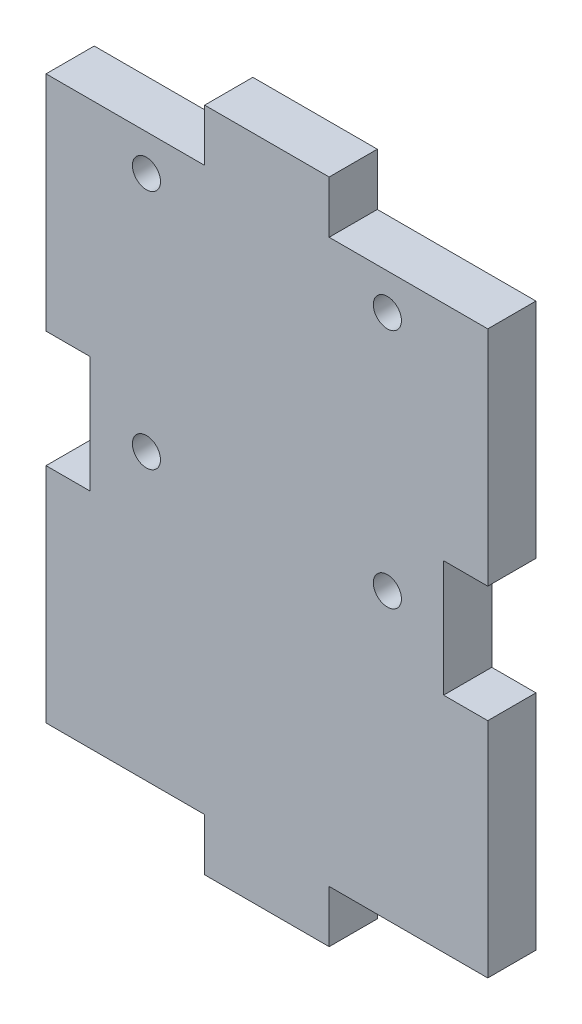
ISO-10303-21;
HEADER;
FILE_DESCRIPTION(('STEP AP214'),'2;1');
FILE_NAME('part.step','',(''),(''),'','','');
FILE_SCHEMA(('AUTOMOTIVE_DESIGN { 1 0 10303 214 1 1 1 1 }'));
ENDSEC;
DATA;
#1=APPLICATION_CONTEXT('core data for automotive mechanical design processes');
#2=APPLICATION_PROTOCOL_DEFINITION('international standard','automotive_design',2000,#1);
#3=PRODUCT_CONTEXT('',#1,'mechanical');
#4=PRODUCT('Part','Part','',(#3));
#5=PRODUCT_RELATED_PRODUCT_CATEGORY('part','',(#4));
#6=PRODUCT_DEFINITION_FORMATION('','',#4);
#7=PRODUCT_DEFINITION_CONTEXT('part definition',#1,'design');
#8=PRODUCT_DEFINITION('design','',#6,#7);
#9=PRODUCT_DEFINITION_SHAPE('','',#8);
#10=(LENGTH_UNIT() NAMED_UNIT(*) SI_UNIT(.MILLI.,.METRE.));
#11=(NAMED_UNIT(*) PLANE_ANGLE_UNIT() SI_UNIT($,.RADIAN.));
#12=(NAMED_UNIT(*) SI_UNIT($,.STERADIAN.) SOLID_ANGLE_UNIT());
#13=UNCERTAINTY_MEASURE_WITH_UNIT(LENGTH_MEASURE(1.E-05),#10,'distance_accuracy_value','');
#14=(GEOMETRIC_REPRESENTATION_CONTEXT(3) GLOBAL_UNCERTAINTY_ASSIGNED_CONTEXT((#13)) GLOBAL_UNIT_ASSIGNED_CONTEXT((#10,
#11,#12)) REPRESENTATION_CONTEXT('',''));
#15=CARTESIAN_POINT('',(0.,0.,0.));
#16=DIRECTION('',(0.,0.,1.));
#17=DIRECTION('',(1.,0.,0.));
#18=AXIS2_PLACEMENT_3D('',#15,#16,#17);
#19=CARTESIAN_POINT('',(7.75,34.9999999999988,6.));
#20=DIRECTION('',(0.,-1.,0.));
#21=DIRECTION('',(1.,0.,0.));
#22=AXIS2_PLACEMENT_3D('',#19,#20,#21);
#23=PLANE('',#22);
#24=DIRECTION('',(-1.,0.,0.));
#25=VECTOR('',#24,1.);
#26=CARTESIAN_POINT('',(7.75,34.9999999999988,0.));
#27=LINE('',#26,#25);
#28=CARTESIAN_POINT('',(27.5,35.,0.));
#29=VERTEX_POINT('',#28);
#30=CARTESIAN_POINT('',(7.75,34.9999999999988,0.));
#31=VERTEX_POINT('',#30);
#32=EDGE_CURVE('E204',#29,#31,#27,.T.);
#33=ORIENTED_EDGE('',*,*,#32,.T.);
#34=DIRECTION('',(0.,0.,-1.));
#35=VECTOR('',#34,1.);
#36=CARTESIAN_POINT('',(7.75,34.9999999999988,6.));
#37=LINE('',#36,#35);
#38=CARTESIAN_POINT('',(7.75,34.9999999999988,6.));
#39=VERTEX_POINT('',#38);
#40=EDGE_CURVE('E11',#39,#31,#37,.T.);
#41=ORIENTED_EDGE('',*,*,#40,.F.);
#42=DIRECTION('',(-1.,0.,0.));
#43=VECTOR('',#42,1.);
#44=CARTESIAN_POINT('',(7.75,34.9999999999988,6.));
#45=LINE('',#44,#43);
#46=CARTESIAN_POINT('',(27.5,35.,6.));
#47=VERTEX_POINT('',#46);
#48=EDGE_CURVE('E243',#47,#39,#45,.T.);
#49=ORIENTED_EDGE('',*,*,#48,.F.);
#50=DIRECTION('',(0.,0.,-1.));
#51=VECTOR('',#50,1.);
#52=CARTESIAN_POINT('',(27.5,35.,6.));
#53=LINE('',#52,#51);
#54=EDGE_CURVE('E200',#47,#29,#53,.T.);
#55=ORIENTED_EDGE('',*,*,#54,.T.);
#56=EDGE_LOOP('',(#33,#41,#49,#55));
#57=FACE_BOUND('',#56,.T.);
#58=ADVANCED_FACE('F36',(#57),#23,.F.);
#59=CARTESIAN_POINT('',(7.75,34.9999999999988,6.));
#60=DIRECTION('',(-1.,0.,0.));
#61=DIRECTION('',(0.,-1.,0.));
#62=AXIS2_PLACEMENT_3D('',#59,#60,#61);
#63=PLANE('',#62);
#64=DIRECTION('',(0.,1.,0.));
#65=VECTOR('',#64,1.);
#66=CARTESIAN_POINT('',(7.75,34.9999999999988,0.));
#67=LINE('',#66,#65);
#68=CARTESIAN_POINT('',(7.75,41.5,0.));
#69=VERTEX_POINT('',#68);
#70=EDGE_CURVE('E207',#31,#69,#67,.T.);
#71=ORIENTED_EDGE('',*,*,#70,.T.);
#72=DIRECTION('',(0.,0.,-1.));
#73=VECTOR('',#72,1.);
#74=CARTESIAN_POINT('',(7.75,41.5,6.));
#75=LINE('',#74,#73);
#76=CARTESIAN_POINT('',(7.75,41.5,6.));
#77=VERTEX_POINT('',#76);
#78=EDGE_CURVE('E44',#77,#69,#75,.T.);
#79=ORIENTED_EDGE('',*,*,#78,.F.);
#80=DIRECTION('',(0.,1.,0.));
#81=VECTOR('',#80,1.);
#82=CARTESIAN_POINT('',(7.75,34.9999999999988,6.));
#83=LINE('',#82,#81);
#84=EDGE_CURVE('E131',#39,#77,#83,.T.);
#85=ORIENTED_EDGE('',*,*,#84,.F.);
#86=ORIENTED_EDGE('',*,*,#40,.T.);
#87=EDGE_LOOP('',(#71,#79,#85,#86));
#88=FACE_BOUND('',#87,.T.);
#89=ADVANCED_FACE('F363',(#88),#63,.F.);
#90=CARTESIAN_POINT('',(-7.75,41.5,6.));
#91=DIRECTION('',(0.,-1.,0.));
#92=DIRECTION('',(0.,0.,-1.));
#93=AXIS2_PLACEMENT_3D('',#90,#91,#92);
#94=PLANE('',#93);
#95=DIRECTION('',(-1.,0.,0.));
#96=VECTOR('',#95,1.);
#97=CARTESIAN_POINT('',(-7.75,41.5,0.));
#98=LINE('',#97,#96);
#99=CARTESIAN_POINT('',(-7.75,41.5,0.));
#100=VERTEX_POINT('',#99);
#101=EDGE_CURVE('E210',#69,#100,#98,.T.);
#102=ORIENTED_EDGE('',*,*,#101,.T.);
#103=DIRECTION('',(0.,0.,-1.));
#104=VECTOR('',#103,1.);
#105=CARTESIAN_POINT('',(-7.75,41.5,6.));
#106=LINE('',#105,#104);
#107=CARTESIAN_POINT('',(-7.75,41.5,6.));
#108=VERTEX_POINT('',#107);
#109=EDGE_CURVE('E286',#108,#100,#106,.T.);
#110=ORIENTED_EDGE('',*,*,#109,.F.);
#111=DIRECTION('',(-1.,0.,0.));
#112=VECTOR('',#111,1.);
#113=CARTESIAN_POINT('',(-7.75,41.5,6.));
#114=LINE('',#113,#112);
#115=EDGE_CURVE('E294',#77,#108,#114,.T.);
#116=ORIENTED_EDGE('',*,*,#115,.F.);
#117=ORIENTED_EDGE('',*,*,#78,.T.);
#118=EDGE_LOOP('',(#102,#110,#116,#117));
#119=FACE_BOUND('',#118,.T.);
#120=ADVANCED_FACE('F292',(#119),#94,.F.);
#121=CARTESIAN_POINT('',(-7.75,35.,6.));
#122=DIRECTION('',(1.,0.,0.));
#123=DIRECTION('',(0.,0.,-1.));
#124=AXIS2_PLACEMENT_3D('',#121,#122,#123);
#125=PLANE('',#124);
#126=DIRECTION('',(0.,-1.,0.));
#127=VECTOR('',#126,1.);
#128=CARTESIAN_POINT('',(-7.75,35.,0.));
#129=LINE('',#128,#127);
#130=CARTESIAN_POINT('',(-7.75,35.,0.));
#131=VERTEX_POINT('',#130);
#132=EDGE_CURVE('E212',#100,#131,#129,.T.);
#133=ORIENTED_EDGE('',*,*,#132,.T.);
#134=DIRECTION('',(0.,0.,-1.));
#135=VECTOR('',#134,1.);
#136=CARTESIAN_POINT('',(-7.75,35.,6.));
#137=LINE('',#136,#135);
#138=CARTESIAN_POINT('',(-7.75,35.,6.));
#139=VERTEX_POINT('',#138);
#140=EDGE_CURVE('E283',#139,#131,#137,.T.);
#141=ORIENTED_EDGE('',*,*,#140,.F.);
#142=DIRECTION('',(0.,-1.,0.));
#143=VECTOR('',#142,1.);
#144=CARTESIAN_POINT('',(-7.75,35.,6.));
#145=LINE('',#144,#143);
#146=EDGE_CURVE('E312',#108,#139,#145,.T.);
#147=ORIENTED_EDGE('',*,*,#146,.F.);
#148=ORIENTED_EDGE('',*,*,#109,.T.);
#149=EDGE_LOOP('',(#133,#141,#147,#148));
#150=FACE_BOUND('',#149,.T.);
#151=ADVANCED_FACE('F303',(#150),#125,.F.);
#152=CARTESIAN_POINT('',(-27.5,35.,6.));
#153=DIRECTION('',(0.,-1.,0.));
#154=DIRECTION('',(0.,0.,-1.));
#155=AXIS2_PLACEMENT_3D('',#152,#153,#154);
#156=PLANE('',#155);
#157=DIRECTION('',(-1.,0.,0.));
#158=VECTOR('',#157,1.);
#159=CARTESIAN_POINT('',(-27.5,35.,0.));
#160=LINE('',#159,#158);
#161=CARTESIAN_POINT('',(-27.5,35.,0.));
#162=VERTEX_POINT('',#161);
#163=EDGE_CURVE('E214',#131,#162,#160,.T.);
#164=ORIENTED_EDGE('',*,*,#163,.T.);
#165=DIRECTION('',(0.,0.,-1.));
#166=VECTOR('',#165,1.);
#167=CARTESIAN_POINT('',(-27.5,35.,6.));
#168=LINE('',#167,#166);
#169=CARTESIAN_POINT('',(-27.5,35.,6.));
#170=VERTEX_POINT('',#169);
#171=EDGE_CURVE('E280',#170,#162,#168,.T.);
#172=ORIENTED_EDGE('',*,*,#171,.F.);
#173=DIRECTION('',(-1.,0.,0.));
#174=VECTOR('',#173,1.);
#175=CARTESIAN_POINT('',(-27.5,35.,6.));
#176=LINE('',#175,#174);
#177=EDGE_CURVE('E309',#139,#170,#176,.T.);
#178=ORIENTED_EDGE('',*,*,#177,.F.);
#179=ORIENTED_EDGE('',*,*,#140,.T.);
#180=EDGE_LOOP('',(#164,#172,#178,#179));
#181=FACE_BOUND('',#180,.T.);
#182=ADVANCED_FACE('F307',(#181),#156,.F.);
#183=CARTESIAN_POINT('',(-27.5,7.25000000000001,6.));
#184=DIRECTION('',(1.,0.,0.));
#185=DIRECTION('',(0.,0.,-1.));
#186=AXIS2_PLACEMENT_3D('',#183,#184,#185);
#187=PLANE('',#186);
#188=DIRECTION('',(0.,-1.,0.));
#189=VECTOR('',#188,1.);
#190=CARTESIAN_POINT('',(-27.5,7.25000000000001,0.));
#191=LINE('',#190,#189);
#192=CARTESIAN_POINT('',(-27.5,7.25000000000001,0.));
#193=VERTEX_POINT('',#192);
#194=EDGE_CURVE('E216',#162,#193,#191,.T.);
#195=ORIENTED_EDGE('',*,*,#194,.T.);
#196=DIRECTION('',(0.,0.,-1.));
#197=VECTOR('',#196,1.);
#198=CARTESIAN_POINT('',(-27.5,7.25000000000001,6.));
#199=LINE('',#198,#197);
#200=CARTESIAN_POINT('',(-27.5,7.25000000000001,6.));
#201=VERTEX_POINT('',#200);
#202=EDGE_CURVE('E277',#201,#193,#199,.T.);
#203=ORIENTED_EDGE('',*,*,#202,.F.);
#204=DIRECTION('',(0.,-1.,0.));
#205=VECTOR('',#204,1.);
#206=CARTESIAN_POINT('',(-27.5,7.25000000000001,6.));
#207=LINE('',#206,#205);
#208=EDGE_CURVE('E311',#170,#201,#207,.T.);
#209=ORIENTED_EDGE('',*,*,#208,.F.);
#210=ORIENTED_EDGE('',*,*,#171,.T.);
#211=EDGE_LOOP('',(#195,#203,#209,#210));
#212=FACE_BOUND('',#211,.T.);
#213=ADVANCED_FACE('F376',(#212),#187,.F.);
#214=CARTESIAN_POINT('',(-27.5,7.25000000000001,6.));
#215=DIRECTION('',(0.,1.,0.));
#216=DIRECTION('',(0.,0.,1.));
#217=AXIS2_PLACEMENT_3D('',#214,#215,#216);
#218=PLANE('',#217);
#219=DIRECTION('',(1.,0.,0.));
#220=VECTOR('',#219,1.);
#221=CARTESIAN_POINT('',(-27.5,7.25000000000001,0.));
#222=LINE('',#221,#220);
#223=CARTESIAN_POINT('',(-22.,7.25000000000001,0.));
#224=VERTEX_POINT('',#223);
#225=EDGE_CURVE('E218',#193,#224,#222,.T.);
#226=ORIENTED_EDGE('',*,*,#225,.T.);
#227=DIRECTION('',(0.,0.,-1.));
#228=VECTOR('',#227,1.);
#229=CARTESIAN_POINT('',(-22.,7.25000000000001,6.));
#230=LINE('',#229,#228);
#231=CARTESIAN_POINT('',(-22.,7.25000000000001,6.));
#232=VERTEX_POINT('',#231);
#233=EDGE_CURVE('E274',#232,#224,#230,.T.);
#234=ORIENTED_EDGE('',*,*,#233,.F.);
#235=DIRECTION('',(1.,0.,0.));
#236=VECTOR('',#235,1.);
#237=CARTESIAN_POINT('',(-27.5,7.25000000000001,6.));
#238=LINE('',#237,#236);
#239=EDGE_CURVE('E314',#201,#232,#238,.T.);
#240=ORIENTED_EDGE('',*,*,#239,.F.);
#241=ORIENTED_EDGE('',*,*,#202,.T.);
#242=EDGE_LOOP('',(#226,#234,#240,#241));
#243=FACE_BOUND('',#242,.T.);
#244=ADVANCED_FACE('F379',(#243),#218,.F.);
#245=CARTESIAN_POINT('',(-22.,-7.24999999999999,6.));
#246=DIRECTION('',(1.,0.,0.));
#247=DIRECTION('',(0.,0.,-1.));
#248=AXIS2_PLACEMENT_3D('',#245,#246,#247);
#249=PLANE('',#248);
#250=DIRECTION('',(0.,-1.,0.));
#251=VECTOR('',#250,1.);
#252=CARTESIAN_POINT('',(-22.,-7.24999999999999,0.));
#253=LINE('',#252,#251);
#254=CARTESIAN_POINT('',(-22.,-7.24999999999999,0.));
#255=VERTEX_POINT('',#254);
#256=EDGE_CURVE('E220',#224,#255,#253,.T.);
#257=ORIENTED_EDGE('',*,*,#256,.T.);
#258=DIRECTION('',(0.,0.,-1.));
#259=VECTOR('',#258,1.);
#260=CARTESIAN_POINT('',(-22.,-7.24999999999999,6.));
#261=LINE('',#260,#259);
#262=CARTESIAN_POINT('',(-22.,-7.24999999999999,6.));
#263=VERTEX_POINT('',#262);
#264=EDGE_CURVE('E271',#263,#255,#261,.T.);
#265=ORIENTED_EDGE('',*,*,#264,.F.);
#266=DIRECTION('',(0.,-1.,0.));
#267=VECTOR('',#266,1.);
#268=CARTESIAN_POINT('',(-22.,-7.24999999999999,6.));
#269=LINE('',#268,#267);
#270=EDGE_CURVE('E320',#232,#263,#269,.T.);
#271=ORIENTED_EDGE('',*,*,#270,.F.);
#272=ORIENTED_EDGE('',*,*,#233,.T.);
#273=EDGE_LOOP('',(#257,#265,#271,#272));
#274=FACE_BOUND('',#273,.T.);
#275=ADVANCED_FACE('F383',(#274),#249,.F.);
#276=CARTESIAN_POINT('',(-27.5,-7.24999999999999,6.));
#277=DIRECTION('',(0.,-1.,0.));
#278=DIRECTION('',(1.,0.,0.));
#279=AXIS2_PLACEMENT_3D('',#276,#277,#278);
#280=PLANE('',#279);
#281=DIRECTION('',(-1.,0.,0.));
#282=VECTOR('',#281,1.);
#283=CARTESIAN_POINT('',(-27.5,-7.24999999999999,0.));
#284=LINE('',#283,#282);
#285=CARTESIAN_POINT('',(-27.5,-7.24999999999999,0.));
#286=VERTEX_POINT('',#285);
#287=EDGE_CURVE('E222',#255,#286,#284,.T.);
#288=ORIENTED_EDGE('',*,*,#287,.T.);
#289=DIRECTION('',(0.,0.,-1.));
#290=VECTOR('',#289,1.);
#291=CARTESIAN_POINT('',(-27.5,-7.24999999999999,6.));
#292=LINE('',#291,#290);
#293=CARTESIAN_POINT('',(-27.5,-7.24999999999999,6.));
#294=VERTEX_POINT('',#293);
#295=EDGE_CURVE('E268',#294,#286,#292,.T.);
#296=ORIENTED_EDGE('',*,*,#295,.F.);
#297=DIRECTION('',(-1.,0.,0.));
#298=VECTOR('',#297,1.);
#299=CARTESIAN_POINT('',(-27.5,-7.24999999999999,6.));
#300=LINE('',#299,#298);
#301=EDGE_CURVE('E322',#263,#294,#300,.T.);
#302=ORIENTED_EDGE('',*,*,#301,.F.);
#303=ORIENTED_EDGE('',*,*,#264,.T.);
#304=EDGE_LOOP('',(#288,#296,#302,#303));
#305=FACE_BOUND('',#304,.T.);
#306=ADVANCED_FACE('F387',(#305),#280,.F.);
#307=CARTESIAN_POINT('',(-27.5,-35.,6.));
#308=DIRECTION('',(1.,0.,0.));
#309=DIRECTION('',(0.,0.,-1.));
#310=AXIS2_PLACEMENT_3D('',#307,#308,#309);
#311=PLANE('',#310);
#312=DIRECTION('',(0.,-1.,0.));
#313=VECTOR('',#312,1.);
#314=CARTESIAN_POINT('',(-27.5,-35.,0.));
#315=LINE('',#314,#313);
#316=CARTESIAN_POINT('',(-27.5,-35.,0.));
#317=VERTEX_POINT('',#316);
#318=EDGE_CURVE('E224',#286,#317,#315,.T.);
#319=ORIENTED_EDGE('',*,*,#318,.T.);
#320=DIRECTION('',(0.,0.,-1.));
#321=VECTOR('',#320,1.);
#322=CARTESIAN_POINT('',(-27.5,-35.,6.));
#323=LINE('',#322,#321);
#324=CARTESIAN_POINT('',(-27.5,-35.,6.));
#325=VERTEX_POINT('',#324);
#326=EDGE_CURVE('E265',#325,#317,#323,.T.);
#327=ORIENTED_EDGE('',*,*,#326,.F.);
#328=DIRECTION('',(0.,-1.,0.));
#329=VECTOR('',#328,1.);
#330=CARTESIAN_POINT('',(-27.5,-35.,6.));
#331=LINE('',#330,#329);
#332=EDGE_CURVE('E324',#294,#325,#331,.T.);
#333=ORIENTED_EDGE('',*,*,#332,.F.);
#334=ORIENTED_EDGE('',*,*,#295,.T.);
#335=EDGE_LOOP('',(#319,#327,#333,#334));
#336=FACE_BOUND('',#335,.T.);
#337=ADVANCED_FACE('F391',(#336),#311,.F.);
#338=CARTESIAN_POINT('',(-27.5,-35.,6.));
#339=DIRECTION('',(0.,1.,0.));
#340=DIRECTION('',(0.,0.,1.));
#341=AXIS2_PLACEMENT_3D('',#338,#339,#340);
#342=PLANE('',#341);
#343=DIRECTION('',(1.,0.,0.));
#344=VECTOR('',#343,1.);
#345=CARTESIAN_POINT('',(-27.5,-35.,0.));
#346=LINE('',#345,#344);
#347=CARTESIAN_POINT('',(-7.75,-35.,0.));
#348=VERTEX_POINT('',#347);
#349=EDGE_CURVE('E226',#317,#348,#346,.T.);
#350=ORIENTED_EDGE('',*,*,#349,.T.);
#351=DIRECTION('',(0.,0.,-1.));
#352=VECTOR('',#351,1.);
#353=CARTESIAN_POINT('',(-7.75,-35.,6.));
#354=LINE('',#353,#352);
#355=CARTESIAN_POINT('',(-7.75,-35.,6.));
#356=VERTEX_POINT('',#355);
#357=EDGE_CURVE('E262',#356,#348,#354,.T.);
#358=ORIENTED_EDGE('',*,*,#357,.F.);
#359=DIRECTION('',(1.,0.,0.));
#360=VECTOR('',#359,1.);
#361=CARTESIAN_POINT('',(-27.5,-35.,6.));
#362=LINE('',#361,#360);
#363=EDGE_CURVE('E326',#325,#356,#362,.T.);
#364=ORIENTED_EDGE('',*,*,#363,.F.);
#365=ORIENTED_EDGE('',*,*,#326,.T.);
#366=EDGE_LOOP('',(#350,#358,#364,#365));
#367=FACE_BOUND('',#366,.T.);
#368=ADVANCED_FACE('F395',(#367),#342,.F.);
#369=CARTESIAN_POINT('',(-7.75,-35.,6.));
#370=DIRECTION('',(1.,0.,0.));
#371=DIRECTION('',(0.,1.,0.));
#372=AXIS2_PLACEMENT_3D('',#369,#370,#371);
#373=PLANE('',#372);
#374=DIRECTION('',(0.,-1.,0.));
#375=VECTOR('',#374,1.);
#376=CARTESIAN_POINT('',(-7.75,-35.,0.));
#377=LINE('',#376,#375);
#378=CARTESIAN_POINT('',(-7.75,-41.5,0.));
#379=VERTEX_POINT('',#378);
#380=EDGE_CURVE('E228',#348,#379,#377,.T.);
#381=ORIENTED_EDGE('',*,*,#380,.T.);
#382=DIRECTION('',(0.,0.,-1.));
#383=VECTOR('',#382,1.);
#384=CARTESIAN_POINT('',(-7.75,-41.5,6.));
#385=LINE('',#384,#383);
#386=CARTESIAN_POINT('',(-7.75,-41.5,6.));
#387=VERTEX_POINT('',#386);
#388=EDGE_CURVE('E259',#387,#379,#385,.T.);
#389=ORIENTED_EDGE('',*,*,#388,.F.);
#390=DIRECTION('',(0.,-1.,0.));
#391=VECTOR('',#390,1.);
#392=CARTESIAN_POINT('',(-7.75,-35.,6.));
#393=LINE('',#392,#391);
#394=EDGE_CURVE('E328',#356,#387,#393,.T.);
#395=ORIENTED_EDGE('',*,*,#394,.F.);
#396=ORIENTED_EDGE('',*,*,#357,.T.);
#397=EDGE_LOOP('',(#381,#389,#395,#396));
#398=FACE_BOUND('',#397,.T.);
#399=ADVANCED_FACE('F399',(#398),#373,.F.);
#400=CARTESIAN_POINT('',(-7.75,-41.5,6.));
#401=DIRECTION('',(0.,1.,0.));
#402=DIRECTION('',(0.,0.,1.));
#403=AXIS2_PLACEMENT_3D('',#400,#401,#402);
#404=PLANE('',#403);
#405=DIRECTION('',(1.,0.,0.));
#406=VECTOR('',#405,1.);
#407=CARTESIAN_POINT('',(-7.75,-41.5,0.));
#408=LINE('',#407,#406);
#409=CARTESIAN_POINT('',(7.75,-41.5,0.));
#410=VERTEX_POINT('',#409);
#411=EDGE_CURVE('E230',#379,#410,#408,.T.);
#412=ORIENTED_EDGE('',*,*,#411,.T.);
#413=DIRECTION('',(0.,0.,-1.));
#414=VECTOR('',#413,1.);
#415=CARTESIAN_POINT('',(7.75,-41.5,6.));
#416=LINE('',#415,#414);
#417=CARTESIAN_POINT('',(7.75,-41.5,6.));
#418=VERTEX_POINT('',#417);
#419=EDGE_CURVE('E256',#418,#410,#416,.T.);
#420=ORIENTED_EDGE('',*,*,#419,.F.);
#421=DIRECTION('',(1.,0.,0.));
#422=VECTOR('',#421,1.);
#423=CARTESIAN_POINT('',(-7.75,-41.5,6.));
#424=LINE('',#423,#422);
#425=EDGE_CURVE('E330',#387,#418,#424,.T.);
#426=ORIENTED_EDGE('',*,*,#425,.F.);
#427=ORIENTED_EDGE('',*,*,#388,.T.);
#428=EDGE_LOOP('',(#412,#420,#426,#427));
#429=FACE_BOUND('',#428,.T.);
#430=ADVANCED_FACE('F403',(#429),#404,.F.);
#431=CARTESIAN_POINT('',(7.75,-35.,6.));
#432=DIRECTION('',(-1.,0.,0.));
#433=DIRECTION('',(0.,-1.,0.));
#434=AXIS2_PLACEMENT_3D('',#431,#432,#433);
#435=PLANE('',#434);
#436=DIRECTION('',(0.,1.,0.));
#437=VECTOR('',#436,1.);
#438=CARTESIAN_POINT('',(7.75,-35.,0.));
#439=LINE('',#438,#437);
#440=CARTESIAN_POINT('',(7.75,-35.,0.));
#441=VERTEX_POINT('',#440);
#442=EDGE_CURVE('E232',#410,#441,#439,.T.);
#443=ORIENTED_EDGE('',*,*,#442,.T.);
#444=DIRECTION('',(0.,0.,-1.));
#445=VECTOR('',#444,1.);
#446=CARTESIAN_POINT('',(7.75,-35.,6.));
#447=LINE('',#446,#445);
#448=CARTESIAN_POINT('',(7.75,-35.,6.));
#449=VERTEX_POINT('',#448);
#450=EDGE_CURVE('E253',#449,#441,#447,.T.);
#451=ORIENTED_EDGE('',*,*,#450,.F.);
#452=DIRECTION('',(0.,1.,0.));
#453=VECTOR('',#452,1.);
#454=CARTESIAN_POINT('',(7.75,-35.,6.));
#455=LINE('',#454,#453);
#456=EDGE_CURVE('E332',#418,#449,#455,.T.);
#457=ORIENTED_EDGE('',*,*,#456,.F.);
#458=ORIENTED_EDGE('',*,*,#419,.T.);
#459=EDGE_LOOP('',(#443,#451,#457,#458));
#460=FACE_BOUND('',#459,.T.);
#461=ADVANCED_FACE('F407',(#460),#435,.F.);
#462=CARTESIAN_POINT('',(7.75,-35.,6.));
#463=DIRECTION('',(0.,1.,0.));
#464=DIRECTION('',(0.,0.,1.));
#465=AXIS2_PLACEMENT_3D('',#462,#463,#464);
#466=PLANE('',#465);
#467=DIRECTION('',(1.,0.,0.));
#468=VECTOR('',#467,1.);
#469=CARTESIAN_POINT('',(7.75,-35.,0.));
#470=LINE('',#469,#468);
#471=CARTESIAN_POINT('',(27.5,-35.,0.));
#472=VERTEX_POINT('',#471);
#473=EDGE_CURVE('E234',#441,#472,#470,.T.);
#474=ORIENTED_EDGE('',*,*,#473,.T.);
#475=DIRECTION('',(0.,0.,-1.));
#476=VECTOR('',#475,1.);
#477=CARTESIAN_POINT('',(27.5,-35.,6.));
#478=LINE('',#477,#476);
#479=CARTESIAN_POINT('',(27.5,-35.,6.));
#480=VERTEX_POINT('',#479);
#481=EDGE_CURVE('E250',#480,#472,#478,.T.);
#482=ORIENTED_EDGE('',*,*,#481,.F.);
#483=DIRECTION('',(1.,0.,0.));
#484=VECTOR('',#483,1.);
#485=CARTESIAN_POINT('',(7.75,-35.,6.));
#486=LINE('',#485,#484);
#487=EDGE_CURVE('E334',#449,#480,#486,.T.);
#488=ORIENTED_EDGE('',*,*,#487,.F.);
#489=ORIENTED_EDGE('',*,*,#450,.T.);
#490=EDGE_LOOP('',(#474,#482,#488,#489));
#491=FACE_BOUND('',#490,.T.);
#492=ADVANCED_FACE('F411',(#491),#466,.F.);
#493=CARTESIAN_POINT('',(27.5,-35.,6.));
#494=DIRECTION('',(-1.,0.,0.));
#495=DIRECTION('',(0.,-1.,0.));
#496=AXIS2_PLACEMENT_3D('',#493,#494,#495);
#497=PLANE('',#496);
#498=DIRECTION('',(0.,1.,0.));
#499=VECTOR('',#498,1.);
#500=CARTESIAN_POINT('',(27.5,-35.,0.));
#501=LINE('',#500,#499);
#502=CARTESIAN_POINT('',(27.5000000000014,-7.24999999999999,0.));
#503=VERTEX_POINT('',#502);
#504=EDGE_CURVE('E236',#472,#503,#501,.T.);
#505=ORIENTED_EDGE('',*,*,#504,.T.);
#506=DIRECTION('',(0.,0.,-1.));
#507=VECTOR('',#506,1.);
#508=CARTESIAN_POINT('',(27.5000000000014,-7.24999999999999,6.));
#509=LINE('',#508,#507);
#510=CARTESIAN_POINT('',(27.5000000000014,-7.24999999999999,6.));
#511=VERTEX_POINT('',#510);
#512=EDGE_CURVE('E247',#511,#503,#509,.T.);
#513=ORIENTED_EDGE('',*,*,#512,.F.);
#514=DIRECTION('',(0.,1.,0.));
#515=VECTOR('',#514,1.);
#516=CARTESIAN_POINT('',(27.5,-35.,6.));
#517=LINE('',#516,#515);
#518=EDGE_CURVE('E336',#480,#511,#517,.T.);
#519=ORIENTED_EDGE('',*,*,#518,.F.);
#520=ORIENTED_EDGE('',*,*,#481,.T.);
#521=EDGE_LOOP('',(#505,#513,#519,#520));
#522=FACE_BOUND('',#521,.T.);
#523=ADVANCED_FACE('F342',(#522),#497,.F.);
#524=CARTESIAN_POINT('',(27.5000000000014,-7.24999999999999,6.));
#525=DIRECTION('',(0.,-1.,0.));
#526=DIRECTION('',(1.,0.,0.));
#527=AXIS2_PLACEMENT_3D('',#524,#525,#526);
#528=PLANE('',#527);
#529=DIRECTION('',(-1.,0.,0.));
#530=VECTOR('',#529,1.);
#531=CARTESIAN_POINT('',(27.5000000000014,-7.24999999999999,0.));
#532=LINE('',#531,#530);
#533=CARTESIAN_POINT('',(22.,-7.24999999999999,0.));
#534=VERTEX_POINT('',#533);
#535=EDGE_CURVE('E238',#503,#534,#532,.T.);
#536=ORIENTED_EDGE('',*,*,#535,.T.);
#537=DIRECTION('',(0.,0.,-1.));
#538=VECTOR('',#537,1.);
#539=CARTESIAN_POINT('',(22.,-7.24999999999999,6.));
#540=LINE('',#539,#538);
#541=CARTESIAN_POINT('',(22.,-7.24999999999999,6.));
#542=VERTEX_POINT('',#541);
#543=EDGE_CURVE('E195',#542,#534,#540,.T.);
#544=ORIENTED_EDGE('',*,*,#543,.F.);
#545=DIRECTION('',(-1.,0.,0.));
#546=VECTOR('',#545,1.);
#547=CARTESIAN_POINT('',(27.5000000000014,-7.24999999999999,6.));
#548=LINE('',#547,#546);
#549=EDGE_CURVE('E186',#511,#542,#548,.T.);
#550=ORIENTED_EDGE('',*,*,#549,.F.);
#551=ORIENTED_EDGE('',*,*,#512,.T.);
#552=EDGE_LOOP('',(#536,#544,#550,#551));
#553=FACE_BOUND('',#552,.T.);
#554=ADVANCED_FACE('F346',(#553),#528,.F.);
#555=CARTESIAN_POINT('',(22.,-7.24999999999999,6.));
#556=DIRECTION('',(-1.,0.,0.));
#557=DIRECTION('',(0.,0.,1.));
#558=AXIS2_PLACEMENT_3D('',#555,#556,#557);
#559=PLANE('',#558);
#560=DIRECTION('',(0.,1.,0.));
#561=VECTOR('',#560,1.);
#562=CARTESIAN_POINT('',(22.,-7.24999999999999,0.));
#563=LINE('',#562,#561);
#564=CARTESIAN_POINT('',(22.,7.25000000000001,0.));
#565=VERTEX_POINT('',#564);
#566=EDGE_CURVE('E194',#534,#565,#563,.T.);
#567=ORIENTED_EDGE('',*,*,#566,.T.);
#568=DIRECTION('',(0.,0.,-1.));
#569=VECTOR('',#568,1.);
#570=CARTESIAN_POINT('',(22.,7.25000000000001,6.));
#571=LINE('',#570,#569);
#572=CARTESIAN_POINT('',(22.,7.25000000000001,6.));
#573=VERTEX_POINT('',#572);
#574=EDGE_CURVE('E191',#573,#565,#571,.T.);
#575=ORIENTED_EDGE('',*,*,#574,.F.);
#576=DIRECTION('',(0.,1.,0.));
#577=VECTOR('',#576,1.);
#578=CARTESIAN_POINT('',(22.,-7.24999999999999,6.));
#579=LINE('',#578,#577);
#580=EDGE_CURVE('E180',#542,#573,#579,.T.);
#581=ORIENTED_EDGE('',*,*,#580,.F.);
#582=ORIENTED_EDGE('',*,*,#543,.T.);
#583=EDGE_LOOP('',(#567,#575,#581,#582));
#584=FACE_BOUND('',#583,.T.);
#585=ADVANCED_FACE('F192',(#584),#559,.F.);
#586=CARTESIAN_POINT('',(27.5,7.25000000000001,6.));
#587=DIRECTION('',(0.,1.,0.));
#588=DIRECTION('',(0.,0.,1.));
#589=AXIS2_PLACEMENT_3D('',#586,#587,#588);
#590=PLANE('',#589);
#591=DIRECTION('',(1.,0.,0.));
#592=VECTOR('',#591,1.);
#593=CARTESIAN_POINT('',(27.5,7.25000000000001,0.));
#594=LINE('',#593,#592);
#595=CARTESIAN_POINT('',(27.5,7.25000000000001,0.));
#596=VERTEX_POINT('',#595);
#597=EDGE_CURVE('E117',#565,#596,#594,.T.);
#598=ORIENTED_EDGE('',*,*,#597,.T.);
#599=DIRECTION('',(0.,0.,-1.));
#600=VECTOR('',#599,1.);
#601=CARTESIAN_POINT('',(27.5,7.25000000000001,6.));
#602=LINE('',#601,#600);
#603=CARTESIAN_POINT('',(27.5,7.25000000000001,6.));
#604=VERTEX_POINT('',#603);
#605=EDGE_CURVE('E196',#604,#596,#602,.T.);
#606=ORIENTED_EDGE('',*,*,#605,.F.);
#607=DIRECTION('',(1.,0.,0.));
#608=VECTOR('',#607,1.);
#609=CARTESIAN_POINT('',(27.5,7.25000000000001,6.));
#610=LINE('',#609,#608);
#611=EDGE_CURVE('E184',#573,#604,#610,.T.);
#612=ORIENTED_EDGE('',*,*,#611,.F.);
#613=ORIENTED_EDGE('',*,*,#574,.T.);
#614=EDGE_LOOP('',(#598,#606,#612,#613));
#615=FACE_BOUND('',#614,.T.);
#616=ADVANCED_FACE('F198',(#615),#590,.F.);
#617=CARTESIAN_POINT('',(27.5,7.25000000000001,6.));
#618=DIRECTION('',(-1.,0.,0.));
#619=DIRECTION('',(0.,0.,1.));
#620=AXIS2_PLACEMENT_3D('',#617,#618,#619);
#621=PLANE('',#620);
#622=DIRECTION('',(0.,1.,0.));
#623=VECTOR('',#622,1.);
#624=CARTESIAN_POINT('',(27.5,7.25000000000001,0.));
#625=LINE('',#624,#623);
#626=EDGE_CURVE('E123',#596,#29,#625,.T.);
#627=ORIENTED_EDGE('',*,*,#626,.T.);
#628=ORIENTED_EDGE('',*,*,#54,.F.);
#629=DIRECTION('',(0.,1.,0.));
#630=VECTOR('',#629,1.);
#631=CARTESIAN_POINT('',(27.5,7.25000000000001,6.));
#632=LINE('',#631,#630);
#633=EDGE_CURVE('E52',#604,#47,#632,.T.);
#634=ORIENTED_EDGE('',*,*,#633,.F.);
#635=ORIENTED_EDGE('',*,*,#605,.T.);
#636=EDGE_LOOP('',(#627,#628,#634,#635));
#637=FACE_BOUND('',#636,.T.);
#638=ADVANCED_FACE('F350',(#637),#621,.F.);
#639=CARTESIAN_POINT('',(0.,0.,6.));
#640=DIRECTION('',(0.,0.,1.));
#641=DIRECTION('',(1.,0.,0.));
#642=AXIS2_PLACEMENT_3D('',#639,#640,#641);
#643=PLANE('',#642);
#644=CARTESIAN_POINT('',(-15.,0.500000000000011,6.));
#645=DIRECTION('',(0.,0.,1.));
#646=DIRECTION('',(1.,0.,0.));
#647=AXIS2_PLACEMENT_3D('',#644,#645,#646);
#648=CIRCLE('',#647,1.75);
#649=CARTESIAN_POINT('',(-13.25,0.500000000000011,6.));
#650=VERTEX_POINT('',#649);
#651=EDGE_CURVE('E208',#650,#650,#648,.T.);
#652=ORIENTED_EDGE('',*,*,#651,.F.);
#653=EDGE_LOOP('',(#652));
#654=FACE_BOUND('',#653,.T.);
#655=CARTESIAN_POINT('',(15.,0.500000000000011,6.));
#656=DIRECTION('',(0.,0.,1.));
#657=DIRECTION('',(1.,0.,0.));
#658=AXIS2_PLACEMENT_3D('',#655,#656,#657);
#659=CIRCLE('',#658,1.75);
#660=CARTESIAN_POINT('',(16.75,0.500000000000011,6.));
#661=VERTEX_POINT('',#660);
#662=EDGE_CURVE('E662',#661,#661,#659,.T.);
#663=ORIENTED_EDGE('',*,*,#662,.F.);
#664=EDGE_LOOP('',(#663));
#665=FACE_BOUND('',#664,.T.);
#666=CARTESIAN_POINT('',(15.,30.5,6.));
#667=DIRECTION('',(0.,0.,1.));
#668=DIRECTION('',(1.,0.,0.));
#669=AXIS2_PLACEMENT_3D('',#666,#667,#668);
#670=CIRCLE('',#669,1.75);
#671=CARTESIAN_POINT('',(16.75,30.5,6.));
#672=VERTEX_POINT('',#671);
#673=EDGE_CURVE('E659',#672,#672,#670,.T.);
#674=ORIENTED_EDGE('',*,*,#673,.F.);
#675=EDGE_LOOP('',(#674));
#676=FACE_BOUND('',#675,.T.);
#677=CARTESIAN_POINT('',(-15.,30.5,6.));
#678=DIRECTION('',(0.,0.,1.));
#679=DIRECTION('',(1.,0.,0.));
#680=AXIS2_PLACEMENT_3D('',#677,#678,#679);
#681=CIRCLE('',#680,1.75);
#682=CARTESIAN_POINT('',(-13.25,30.5,6.));
#683=VERTEX_POINT('',#682);
#684=EDGE_CURVE('E656',#683,#683,#681,.T.);
#685=ORIENTED_EDGE('',*,*,#684,.F.);
#686=EDGE_LOOP('',(#685));
#687=FACE_BOUND('',#686,.T.);
#688=ORIENTED_EDGE('',*,*,#48,.T.);
#689=ORIENTED_EDGE('',*,*,#84,.T.);
#690=ORIENTED_EDGE('',*,*,#115,.T.);
#691=ORIENTED_EDGE('',*,*,#146,.T.);
#692=ORIENTED_EDGE('',*,*,#177,.T.);
#693=ORIENTED_EDGE('',*,*,#208,.T.);
#694=ORIENTED_EDGE('',*,*,#239,.T.);
#695=ORIENTED_EDGE('',*,*,#270,.T.);
#696=ORIENTED_EDGE('',*,*,#301,.T.);
#697=ORIENTED_EDGE('',*,*,#332,.T.);
#698=ORIENTED_EDGE('',*,*,#363,.T.);
#699=ORIENTED_EDGE('',*,*,#394,.T.);
#700=ORIENTED_EDGE('',*,*,#425,.T.);
#701=ORIENTED_EDGE('',*,*,#456,.T.);
#702=ORIENTED_EDGE('',*,*,#487,.T.);
#703=ORIENTED_EDGE('',*,*,#518,.T.);
#704=ORIENTED_EDGE('',*,*,#549,.T.);
#705=ORIENTED_EDGE('',*,*,#580,.T.);
#706=ORIENTED_EDGE('',*,*,#611,.T.);
#707=ORIENTED_EDGE('',*,*,#633,.T.);
#708=EDGE_LOOP('',(#688,#689,#690,#691,#692,#693,#694,#695,#696,#697,#698,#699,#700,#701,#702,
#703,#704,#705,#706,#707));
#709=FACE_BOUND('',#708,.T.);
#710=ADVANCED_FACE('F182',(#654,#665,#676,#687,#709),#643,.T.);
#711=CARTESIAN_POINT('',(0.,0.,0.));
#712=DIRECTION('',(0.,0.,1.));
#713=DIRECTION('',(1.,0.,0.));
#714=AXIS2_PLACEMENT_3D('',#711,#712,#713);
#715=PLANE('',#714);
#716=CARTESIAN_POINT('',(-15.,0.500000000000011,0.));
#717=DIRECTION('',(0.,0.,1.));
#718=DIRECTION('',(-1.,0.,0.));
#719=AXIS2_PLACEMENT_3D('',#716,#717,#718);
#720=CIRCLE('',#719,1.75);
#721=CARTESIAN_POINT('',(-16.75,0.500000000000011,0.));
#722=VERTEX_POINT('',#721);
#723=EDGE_CURVE('E645',#722,#722,#720,.T.);
#724=ORIENTED_EDGE('',*,*,#723,.T.);
#725=EDGE_LOOP('',(#724));
#726=FACE_BOUND('',#725,.T.);
#727=CARTESIAN_POINT('',(15.,0.500000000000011,0.));
#728=DIRECTION('',(0.,0.,1.));
#729=DIRECTION('',(1.,0.,0.));
#730=AXIS2_PLACEMENT_3D('',#727,#728,#729);
#731=CIRCLE('',#730,1.75);
#732=CARTESIAN_POINT('',(16.75,0.500000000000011,0.));
#733=VERTEX_POINT('',#732);
#734=EDGE_CURVE('E646',#733,#733,#731,.T.);
#735=ORIENTED_EDGE('',*,*,#734,.T.);
#736=EDGE_LOOP('',(#735));
#737=FACE_BOUND('',#736,.T.);
#738=CARTESIAN_POINT('',(15.,30.5,0.));
#739=DIRECTION('',(0.,0.,1.));
#740=DIRECTION('',(-1.,0.,0.));
#741=AXIS2_PLACEMENT_3D('',#738,#739,#740);
#742=CIRCLE('',#741,1.75);
#743=CARTESIAN_POINT('',(13.25,30.5,0.));
#744=VERTEX_POINT('',#743);
#745=EDGE_CURVE('E649',#744,#744,#742,.T.);
#746=ORIENTED_EDGE('',*,*,#745,.T.);
#747=EDGE_LOOP('',(#746));
#748=FACE_BOUND('',#747,.T.);
#749=CARTESIAN_POINT('',(-15.,30.5,0.));
#750=DIRECTION('',(0.,0.,1.));
#751=DIRECTION('',(1.,0.,0.));
#752=AXIS2_PLACEMENT_3D('',#749,#750,#751);
#753=CIRCLE('',#752,1.75);
#754=CARTESIAN_POINT('',(-13.25,30.5,0.));
#755=VERTEX_POINT('',#754);
#756=EDGE_CURVE('E653',#755,#755,#753,.T.);
#757=ORIENTED_EDGE('',*,*,#756,.T.);
#758=EDGE_LOOP('',(#757));
#759=FACE_BOUND('',#758,.T.);
#760=ORIENTED_EDGE('',*,*,#32,.F.);
#761=ORIENTED_EDGE('',*,*,#626,.F.);
#762=ORIENTED_EDGE('',*,*,#597,.F.);
#763=ORIENTED_EDGE('',*,*,#566,.F.);
#764=ORIENTED_EDGE('',*,*,#535,.F.);
#765=ORIENTED_EDGE('',*,*,#504,.F.);
#766=ORIENTED_EDGE('',*,*,#473,.F.);
#767=ORIENTED_EDGE('',*,*,#442,.F.);
#768=ORIENTED_EDGE('',*,*,#411,.F.);
#769=ORIENTED_EDGE('',*,*,#380,.F.);
#770=ORIENTED_EDGE('',*,*,#349,.F.);
#771=ORIENTED_EDGE('',*,*,#318,.F.);
#772=ORIENTED_EDGE('',*,*,#287,.F.);
#773=ORIENTED_EDGE('',*,*,#256,.F.);
#774=ORIENTED_EDGE('',*,*,#225,.F.);
#775=ORIENTED_EDGE('',*,*,#194,.F.);
#776=ORIENTED_EDGE('',*,*,#163,.F.);
#777=ORIENTED_EDGE('',*,*,#132,.F.);
#778=ORIENTED_EDGE('',*,*,#101,.F.);
#779=ORIENTED_EDGE('',*,*,#70,.F.);
#780=EDGE_LOOP('',(#760,#761,#762,#763,#764,#765,#766,#767,#768,#769,#770,#771,#772,#773,#774,
#775,#776,#777,#778,#779));
#781=FACE_BOUND('',#780,.T.);
#782=ADVANCED_FACE('F298',(#726,#737,#748,#759,#781),#715,.F.);
#783=CARTESIAN_POINT('',(-15.,30.5,0.));
#784=DIRECTION('',(0.,0.,1.));
#785=DIRECTION('',(1.,0.,0.));
#786=AXIS2_PLACEMENT_3D('',#783,#784,#785);
#787=CYLINDRICAL_SURFACE('',#786,1.75);
#788=ORIENTED_EDGE('',*,*,#684,.T.);
#789=EDGE_LOOP('',(#788));
#790=FACE_BOUND('',#789,.T.);
#791=ORIENTED_EDGE('',*,*,#756,.F.);
#792=EDGE_LOOP('',(#791));
#793=FACE_BOUND('',#792,.T.);
#794=ADVANCED_FACE('F446',(#790,#793),#787,.F.);
#795=CARTESIAN_POINT('',(15.,30.5,0.));
#796=DIRECTION('',(0.,0.,1.));
#797=DIRECTION('',(1.,0.,0.));
#798=AXIS2_PLACEMENT_3D('',#795,#796,#797);
#799=CYLINDRICAL_SURFACE('',#798,1.75);
#800=ORIENTED_EDGE('',*,*,#673,.T.);
#801=EDGE_LOOP('',(#800));
#802=FACE_BOUND('',#801,.T.);
#803=ORIENTED_EDGE('',*,*,#745,.F.);
#804=EDGE_LOOP('',(#803));
#805=FACE_BOUND('',#804,.T.);
#806=ADVANCED_FACE('F454',(#802,#805),#799,.F.);
#807=CARTESIAN_POINT('',(15.,0.500000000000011,0.));
#808=DIRECTION('',(0.,0.,1.));
#809=DIRECTION('',(1.,0.,0.));
#810=AXIS2_PLACEMENT_3D('',#807,#808,#809);
#811=CYLINDRICAL_SURFACE('',#810,1.75);
#812=ORIENTED_EDGE('',*,*,#662,.T.);
#813=EDGE_LOOP('',(#812));
#814=FACE_BOUND('',#813,.T.);
#815=ORIENTED_EDGE('',*,*,#734,.F.);
#816=EDGE_LOOP('',(#815));
#817=FACE_BOUND('',#816,.T.);
#818=ADVANCED_FACE('F465',(#814,#817),#811,.F.);
#819=CARTESIAN_POINT('',(-15.,0.500000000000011,0.));
#820=DIRECTION('',(0.,0.,1.));
#821=DIRECTION('',(1.,0.,0.));
#822=AXIS2_PLACEMENT_3D('',#819,#820,#821);
#823=CYLINDRICAL_SURFACE('',#822,1.75);
#824=ORIENTED_EDGE('',*,*,#651,.T.);
#825=EDGE_LOOP('',(#824));
#826=FACE_BOUND('',#825,.T.);
#827=ORIENTED_EDGE('',*,*,#723,.F.);
#828=EDGE_LOOP('',(#827));
#829=FACE_BOUND('',#828,.T.);
#830=ADVANCED_FACE('F476',(#826,#829),#823,.F.);
#831=CLOSED_SHELL('',(#58,#89,#120,#151,#182,#213,#244,#275,#306,#337,#368,#399,#430,#461,#492,
#523,#554,#585,#616,#638,#710,#782,#794,#806,#818,#830));
#832=MANIFOLD_SOLID_BREP('B2',#831);
#833=ADVANCED_BREP_SHAPE_REPRESENTATION('',(#18,#832),#14);
#834=SHAPE_DEFINITION_REPRESENTATION(#9,#833);
ENDSEC;
END-ISO-10303-21;
